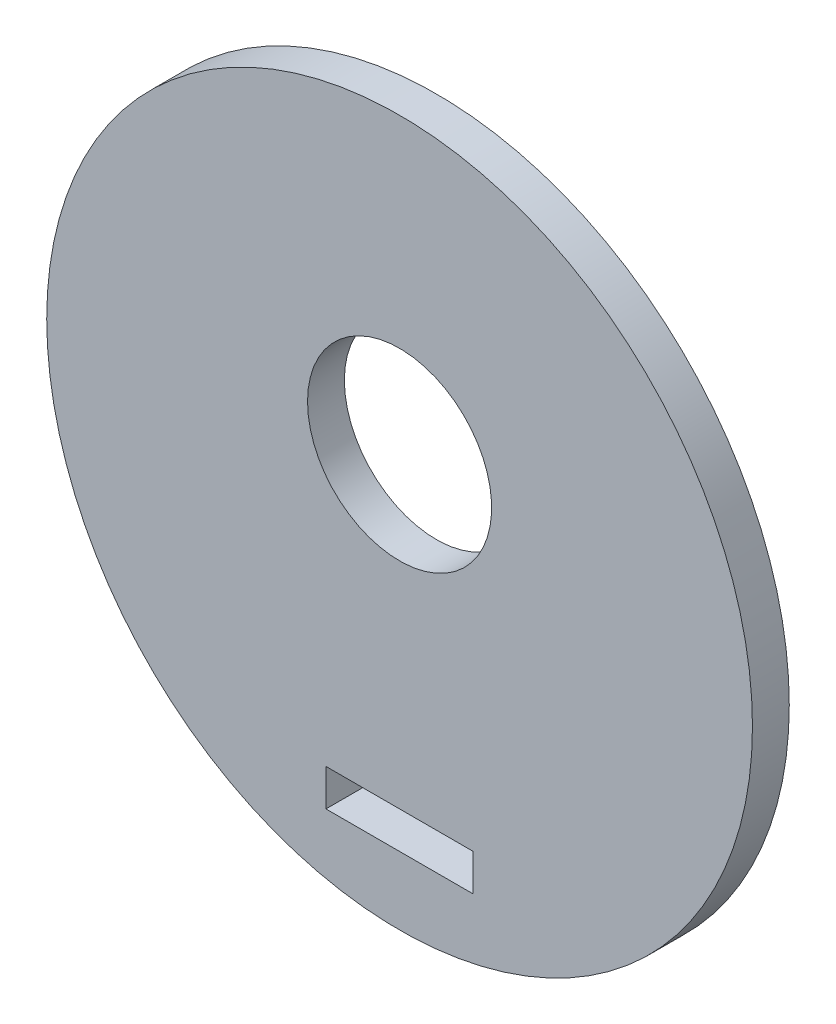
ISO-10303-21;
HEADER;
FILE_DESCRIPTION(('STEP AP214'),'2;1');
FILE_NAME('part.step','',(''),(''),'','','');
FILE_SCHEMA(('AUTOMOTIVE_DESIGN { 1 0 10303 214 1 1 1 1 }'));
ENDSEC;
DATA;
#1=APPLICATION_CONTEXT('core data for automotive mechanical design processes');
#2=APPLICATION_PROTOCOL_DEFINITION('international standard','automotive_design',2000,#1);
#3=PRODUCT_CONTEXT('',#1,'mechanical');
#4=PRODUCT('Part','Part','',(#3));
#5=PRODUCT_RELATED_PRODUCT_CATEGORY('part','',(#4));
#6=PRODUCT_DEFINITION_FORMATION('','',#4);
#7=PRODUCT_DEFINITION_CONTEXT('part definition',#1,'design');
#8=PRODUCT_DEFINITION('design','',#6,#7);
#9=PRODUCT_DEFINITION_SHAPE('','',#8);
#10=(LENGTH_UNIT() NAMED_UNIT(*) SI_UNIT(.MILLI.,.METRE.));
#11=(NAMED_UNIT(*) PLANE_ANGLE_UNIT() SI_UNIT($,.RADIAN.));
#12=(NAMED_UNIT(*) SI_UNIT($,.STERADIAN.) SOLID_ANGLE_UNIT());
#13=UNCERTAINTY_MEASURE_WITH_UNIT(LENGTH_MEASURE(1.E-05),#10,'distance_accuracy_value','');
#14=(GEOMETRIC_REPRESENTATION_CONTEXT(3) GLOBAL_UNCERTAINTY_ASSIGNED_CONTEXT((#13)) GLOBAL_UNIT_ASSIGNED_CONTEXT((#10,
#11,#12)) REPRESENTATION_CONTEXT('',''));
#15=CARTESIAN_POINT('',(0.,0.,0.));
#16=DIRECTION('',(0.,0.,1.));
#17=DIRECTION('',(1.,0.,0.));
#18=AXIS2_PLACEMENT_3D('',#15,#16,#17);
#19=CARTESIAN_POINT('',(0.,0.,3.81));
#20=DIRECTION('',(0.,0.,1.));
#21=DIRECTION('',(1.,0.,0.));
#22=AXIS2_PLACEMENT_3D('',#19,#20,#21);
#23=PLANE('',#22);
#24=CARTESIAN_POINT('',(0.,6.096,3.81));
#25=DIRECTION('',(0.,0.,1.));
#26=DIRECTION('',(1.,0.,0.));
#27=AXIS2_PLACEMENT_3D('',#24,#25,#26);
#28=CIRCLE('',#27,9.525);
#29=CARTESIAN_POINT('',(-9.525,6.096,3.81));
#30=VERTEX_POINT('',#29);
#31=EDGE_CURVE('E110',#30,#30,#28,.T.);
#32=ORIENTED_EDGE('',*,*,#31,.F.);
#33=EDGE_LOOP('',(#32));
#34=FACE_BOUND('',#33,.T.);
#35=CARTESIAN_POINT('',(0.,0.,3.81));
#36=DIRECTION('',(0.,0.,1.));
#37=DIRECTION('',(1.,0.,0.));
#38=AXIS2_PLACEMENT_3D('',#35,#36,#37);
#39=CIRCLE('',#38,36.5125);
#40=CARTESIAN_POINT('',(-36.5125,0.,3.81));
#41=VERTEX_POINT('',#40);
#42=EDGE_CURVE('E11',#41,#41,#39,.T.);
#43=ORIENTED_EDGE('',*,*,#42,.T.);
#44=EDGE_LOOP('',(#43));
#45=FACE_BOUND('',#44,.T.);
#46=DIRECTION('',(1.,0.,0.));
#47=VECTOR('',#46,1.);
#48=CARTESIAN_POINT('',(-7.61999999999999,-29.464,3.81));
#49=LINE('',#48,#47);
#50=CARTESIAN_POINT('',(-7.61999999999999,-29.464,3.81));
#51=VERTEX_POINT('',#50);
#52=CARTESIAN_POINT('',(7.62000000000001,-29.464,3.81));
#53=VERTEX_POINT('',#52);
#54=EDGE_CURVE('E98',#51,#53,#49,.T.);
#55=ORIENTED_EDGE('',*,*,#54,.F.);
#56=DIRECTION('',(0.,-1.,0.));
#57=VECTOR('',#56,1.);
#58=CARTESIAN_POINT('',(-7.61999999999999,-25.654,3.81));
#59=LINE('',#58,#57);
#60=CARTESIAN_POINT('',(-7.61999999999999,-25.654,3.81));
#61=VERTEX_POINT('',#60);
#62=EDGE_CURVE('E87',#61,#51,#59,.T.);
#63=ORIENTED_EDGE('',*,*,#62,.F.);
#64=DIRECTION('',(-1.,0.,0.));
#65=VECTOR('',#64,1.);
#66=CARTESIAN_POINT('',(-7.61999999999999,-25.654,3.81));
#67=LINE('',#66,#65);
#68=CARTESIAN_POINT('',(7.62000000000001,-25.654,3.81));
#69=VERTEX_POINT('',#68);
#70=EDGE_CURVE('E102',#69,#61,#67,.T.);
#71=ORIENTED_EDGE('',*,*,#70,.F.);
#72=DIRECTION('',(0.,1.,0.));
#73=VECTOR('',#72,1.);
#74=CARTESIAN_POINT('',(7.62000000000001,-29.464,3.81));
#75=LINE('',#74,#73);
#76=EDGE_CURVE('E100',#53,#69,#75,.T.);
#77=ORIENTED_EDGE('',*,*,#76,.F.);
#78=EDGE_LOOP('',(#55,#63,#71,#77));
#79=FACE_BOUND('',#78,.T.);
#80=ADVANCED_FACE('F31',(#34,#45,#79),#23,.T.);
#81=CARTESIAN_POINT('',(0.,0.,0.));
#82=DIRECTION('',(0.,0.,1.));
#83=DIRECTION('',(1.,0.,0.));
#84=AXIS2_PLACEMENT_3D('',#81,#82,#83);
#85=PLANE('',#84);
#86=CARTESIAN_POINT('',(0.,6.096,0.));
#87=DIRECTION('',(0.,0.,1.));
#88=DIRECTION('',(1.,0.,0.));
#89=AXIS2_PLACEMENT_3D('',#86,#87,#88);
#90=CIRCLE('',#89,9.525);
#91=CARTESIAN_POINT('',(-9.525,6.096,0.));
#92=VERTEX_POINT('',#91);
#93=EDGE_CURVE('E88',#92,#92,#90,.T.);
#94=ORIENTED_EDGE('',*,*,#93,.T.);
#95=EDGE_LOOP('',(#94));
#96=FACE_BOUND('',#95,.T.);
#97=CARTESIAN_POINT('',(0.,0.,0.));
#98=DIRECTION('',(0.,0.,1.));
#99=DIRECTION('',(1.,0.,0.));
#100=AXIS2_PLACEMENT_3D('',#97,#98,#99);
#101=CIRCLE('',#100,36.5125);
#102=CARTESIAN_POINT('',(-36.5125,0.,0.));
#103=VERTEX_POINT('',#102);
#104=EDGE_CURVE('E39',#103,#103,#101,.T.);
#105=ORIENTED_EDGE('',*,*,#104,.F.);
#106=EDGE_LOOP('',(#105));
#107=FACE_BOUND('',#106,.T.);
#108=DIRECTION('',(0.,-1.,0.));
#109=VECTOR('',#108,1.);
#110=CARTESIAN_POINT('',(-7.61999999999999,-25.654,0.));
#111=LINE('',#110,#109);
#112=CARTESIAN_POINT('',(-7.61999999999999,-25.654,0.));
#113=VERTEX_POINT('',#112);
#114=CARTESIAN_POINT('',(-7.61999999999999,-29.464,0.));
#115=VERTEX_POINT('',#114);
#116=EDGE_CURVE('E54',#113,#115,#111,.T.);
#117=ORIENTED_EDGE('',*,*,#116,.T.);
#118=DIRECTION('',(1.,0.,0.));
#119=VECTOR('',#118,1.);
#120=CARTESIAN_POINT('',(-7.61999999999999,-29.464,0.));
#121=LINE('',#120,#119);
#122=CARTESIAN_POINT('',(7.62000000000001,-29.464,0.));
#123=VERTEX_POINT('',#122);
#124=EDGE_CURVE('E74',#115,#123,#121,.T.);
#125=ORIENTED_EDGE('',*,*,#124,.T.);
#126=DIRECTION('',(0.,1.,0.));
#127=VECTOR('',#126,1.);
#128=CARTESIAN_POINT('',(7.62000000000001,-29.464,0.));
#129=LINE('',#128,#127);
#130=CARTESIAN_POINT('',(7.62000000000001,-25.654,0.));
#131=VERTEX_POINT('',#130);
#132=EDGE_CURVE('E83',#123,#131,#129,.T.);
#133=ORIENTED_EDGE('',*,*,#132,.T.);
#134=DIRECTION('',(-1.,0.,0.));
#135=VECTOR('',#134,1.);
#136=CARTESIAN_POINT('',(-7.61999999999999,-25.654,0.));
#137=LINE('',#136,#135);
#138=EDGE_CURVE('E92',#131,#113,#137,.T.);
#139=ORIENTED_EDGE('',*,*,#138,.T.);
#140=EDGE_LOOP('',(#117,#125,#133,#139));
#141=FACE_BOUND('',#140,.T.);
#142=ADVANCED_FACE('F91',(#96,#107,#141),#85,.F.);
#143=CARTESIAN_POINT('',(0.,0.,3.81));
#144=DIRECTION('',(0.,0.,-1.));
#145=DIRECTION('',(-1.,0.,0.));
#146=AXIS2_PLACEMENT_3D('',#143,#144,#145);
#147=CYLINDRICAL_SURFACE('',#146,36.5125);
#148=CARTESIAN_POINT('',(-36.5125,0.,3.81));
#149=CARTESIAN_POINT('',(-36.5125,0.,3.7703125));
#150=CARTESIAN_POINT('',(-36.5125,0.,3.730625));
#151=CARTESIAN_POINT('',(-36.5125,0.,3.65125));
#152=CARTESIAN_POINT('',(-36.5125,0.,3.6115625));
#153=CARTESIAN_POINT('',(-36.5125,0.,3.5321875));
#154=CARTESIAN_POINT('',(-36.5125,0.,3.4925));
#155=CARTESIAN_POINT('',(-36.5125,0.,3.413125));
#156=CARTESIAN_POINT('',(-36.5125,0.,3.3734375));
#157=CARTESIAN_POINT('',(-36.5125,0.,3.2940625));
#158=CARTESIAN_POINT('',(-36.5125,0.,3.254375));
#159=CARTESIAN_POINT('',(-36.5125,0.,3.175));
#160=CARTESIAN_POINT('',(-36.5125,0.,3.1353125));
#161=CARTESIAN_POINT('',(-36.5125,0.,3.0559375));
#162=CARTESIAN_POINT('',(-36.5125,0.,3.01625));
#163=CARTESIAN_POINT('',(-36.5125,0.,2.936875));
#164=CARTESIAN_POINT('',(-36.5125,0.,2.8971875));
#165=CARTESIAN_POINT('',(-36.5125,0.,2.8178125));
#166=CARTESIAN_POINT('',(-36.5125,0.,2.778125));
#167=CARTESIAN_POINT('',(-36.5125,0.,2.69875));
#168=CARTESIAN_POINT('',(-36.5125,0.,2.6590625));
#169=CARTESIAN_POINT('',(-36.5125,0.,2.5796875));
#170=CARTESIAN_POINT('',(-36.5125,0.,2.54));
#171=CARTESIAN_POINT('',(-36.5125,0.,2.460625));
#172=CARTESIAN_POINT('',(-36.5125,0.,2.4209375));
#173=CARTESIAN_POINT('',(-36.5125,0.,2.3415625));
#174=CARTESIAN_POINT('',(-36.5125,0.,2.301875));
#175=CARTESIAN_POINT('',(-36.5125,0.,2.2225));
#176=CARTESIAN_POINT('',(-36.5125,0.,2.1828125));
#177=CARTESIAN_POINT('',(-36.5125,0.,2.1034375));
#178=CARTESIAN_POINT('',(-36.5125,0.,2.06375));
#179=CARTESIAN_POINT('',(-36.5125,0.,1.984375));
#180=CARTESIAN_POINT('',(-36.5125,0.,1.9446875));
#181=CARTESIAN_POINT('',(-36.5125,0.,1.8653125));
#182=CARTESIAN_POINT('',(-36.5125,0.,1.825625));
#183=CARTESIAN_POINT('',(-36.5125,0.,1.74625));
#184=CARTESIAN_POINT('',(-36.5125,0.,1.7065625));
#185=CARTESIAN_POINT('',(-36.5125,0.,1.6271875));
#186=CARTESIAN_POINT('',(-36.5125,0.,1.5875));
#187=CARTESIAN_POINT('',(-36.5125,0.,1.508125));
#188=CARTESIAN_POINT('',(-36.5125,0.,1.4684375));
#189=CARTESIAN_POINT('',(-36.5125,0.,1.3890625));
#190=CARTESIAN_POINT('',(-36.5125,0.,1.349375));
#191=CARTESIAN_POINT('',(-36.5125,0.,1.27));
#192=CARTESIAN_POINT('',(-36.5125,0.,1.2303125));
#193=CARTESIAN_POINT('',(-36.5125,0.,1.1509375));
#194=CARTESIAN_POINT('',(-36.5125,0.,1.11125));
#195=CARTESIAN_POINT('',(-36.5125,0.,1.031875));
#196=CARTESIAN_POINT('',(-36.5125,0.,0.9921875));
#197=CARTESIAN_POINT('',(-36.5125,0.,0.9128125));
#198=CARTESIAN_POINT('',(-36.5125,0.,0.873125));
#199=CARTESIAN_POINT('',(-36.5125,0.,0.79375));
#200=CARTESIAN_POINT('',(-36.5125,0.,0.7540625));
#201=CARTESIAN_POINT('',(-36.5125,0.,0.6746875));
#202=CARTESIAN_POINT('',(-36.5125,0.,0.635));
#203=CARTESIAN_POINT('',(-36.5125,0.,0.555625));
#204=CARTESIAN_POINT('',(-36.5125,0.,0.5159375));
#205=CARTESIAN_POINT('',(-36.5125,0.,0.4365625));
#206=CARTESIAN_POINT('',(-36.5125,0.,0.396875));
#207=CARTESIAN_POINT('',(-36.5125,0.,0.3175));
#208=CARTESIAN_POINT('',(-36.5125,0.,0.2778125));
#209=CARTESIAN_POINT('',(-36.5125,0.,0.1984375));
#210=CARTESIAN_POINT('',(-36.5125,0.,0.15875));
#211=CARTESIAN_POINT('',(-36.5125,0.,0.0793749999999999));
#212=CARTESIAN_POINT('',(-36.5125,0.,0.0396874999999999));
#213=CARTESIAN_POINT('',(-36.5125,0.,0.));
#214=B_SPLINE_CURVE_WITH_KNOTS('',3,(#148,#149,#150,#151,#152,#153,#154,#155,#156,#157,#158,
#159,#160,#161,#162,#163,#164,#165,#166,#167,#168,#169,#170,#171,#172,#173,#174,#175,#176,#177,
#178,#179,#180,#181,#182,#183,#184,#185,#186,#187,#188,#189,#190,#191,#192,#193,#194,#195,#196,
#197,#198,#199,#200,#201,#202,#203,#204,#205,#206,#207,#208,#209,#210,#211,#212,#213),
.UNSPECIFIED.,.F.,.F.,(4,2,2,2,2,2,2,2,2,2,2,2,2,2,2,2,2,2,2,2,2,2,2,2,2,2,2,2,2,2,2,2,4),(0.,
0.1190625,0.238125,0.3571875,0.47625,0.5953125,0.714375,0.8334375,0.9525,1.0715625,1.190625,
1.3096875,1.42875,1.5478125,1.666875,1.7859375,1.905,2.0240625,2.143125,2.2621875,2.38125,
2.5003125,2.619375,2.7384375,2.8575,2.9765625,3.095625,3.2146875,3.33375,3.4528125,3.571875,
3.6909375,3.81),.UNSPECIFIED.);
#215=EDGE_CURVE('BSEAM33',#41,#103,#214,.T.);
#216=ORIENTED_EDGE('',*,*,#42,.F.);
#217=ORIENTED_EDGE('',*,*,#104,.T.);
#218=ORIENTED_EDGE('',*,*,#215,.T.);
#219=ORIENTED_EDGE('',*,*,#215,.F.);
#220=EDGE_LOOP('',(#216,#218,#217,#219));
#221=FACE_BOUND('',#220,.T.);
#222=ADVANCED_FACE('F33',(#221),#147,.T.);
#223=CARTESIAN_POINT('',(0.,6.096,3.81));
#224=DIRECTION('',(0.,0.,-1.));
#225=DIRECTION('',(-1.,0.,0.));
#226=AXIS2_PLACEMENT_3D('',#223,#224,#225);
#227=CYLINDRICAL_SURFACE('',#226,9.525);
#228=CARTESIAN_POINT('',(-9.525,6.096,3.81));
#229=CARTESIAN_POINT('',(-9.525,6.096,3.7703125));
#230=CARTESIAN_POINT('',(-9.525,6.096,3.730625));
#231=CARTESIAN_POINT('',(-9.525,6.096,3.65125));
#232=CARTESIAN_POINT('',(-9.525,6.096,3.6115625));
#233=CARTESIAN_POINT('',(-9.525,6.096,3.5321875));
#234=CARTESIAN_POINT('',(-9.525,6.096,3.4925));
#235=CARTESIAN_POINT('',(-9.525,6.096,3.413125));
#236=CARTESIAN_POINT('',(-9.525,6.096,3.3734375));
#237=CARTESIAN_POINT('',(-9.525,6.096,3.2940625));
#238=CARTESIAN_POINT('',(-9.525,6.096,3.254375));
#239=CARTESIAN_POINT('',(-9.525,6.096,3.175));
#240=CARTESIAN_POINT('',(-9.525,6.096,3.1353125));
#241=CARTESIAN_POINT('',(-9.525,6.096,3.0559375));
#242=CARTESIAN_POINT('',(-9.525,6.096,3.01625));
#243=CARTESIAN_POINT('',(-9.525,6.096,2.936875));
#244=CARTESIAN_POINT('',(-9.525,6.096,2.8971875));
#245=CARTESIAN_POINT('',(-9.525,6.096,2.8178125));
#246=CARTESIAN_POINT('',(-9.525,6.096,2.778125));
#247=CARTESIAN_POINT('',(-9.525,6.096,2.69875));
#248=CARTESIAN_POINT('',(-9.525,6.096,2.6590625));
#249=CARTESIAN_POINT('',(-9.525,6.096,2.5796875));
#250=CARTESIAN_POINT('',(-9.525,6.096,2.54));
#251=CARTESIAN_POINT('',(-9.525,6.096,2.460625));
#252=CARTESIAN_POINT('',(-9.525,6.096,2.4209375));
#253=CARTESIAN_POINT('',(-9.525,6.096,2.3415625));
#254=CARTESIAN_POINT('',(-9.525,6.096,2.301875));
#255=CARTESIAN_POINT('',(-9.525,6.096,2.2225));
#256=CARTESIAN_POINT('',(-9.525,6.096,2.1828125));
#257=CARTESIAN_POINT('',(-9.525,6.096,2.1034375));
#258=CARTESIAN_POINT('',(-9.525,6.096,2.06375));
#259=CARTESIAN_POINT('',(-9.525,6.096,1.984375));
#260=CARTESIAN_POINT('',(-9.525,6.096,1.9446875));
#261=CARTESIAN_POINT('',(-9.525,6.096,1.8653125));
#262=CARTESIAN_POINT('',(-9.525,6.096,1.825625));
#263=CARTESIAN_POINT('',(-9.525,6.096,1.74625));
#264=CARTESIAN_POINT('',(-9.525,6.096,1.7065625));
#265=CARTESIAN_POINT('',(-9.525,6.096,1.6271875));
#266=CARTESIAN_POINT('',(-9.525,6.096,1.5875));
#267=CARTESIAN_POINT('',(-9.525,6.096,1.508125));
#268=CARTESIAN_POINT('',(-9.525,6.096,1.4684375));
#269=CARTESIAN_POINT('',(-9.525,6.096,1.3890625));
#270=CARTESIAN_POINT('',(-9.525,6.096,1.349375));
#271=CARTESIAN_POINT('',(-9.525,6.096,1.27));
#272=CARTESIAN_POINT('',(-9.525,6.096,1.2303125));
#273=CARTESIAN_POINT('',(-9.525,6.096,1.1509375));
#274=CARTESIAN_POINT('',(-9.525,6.096,1.11125));
#275=CARTESIAN_POINT('',(-9.525,6.096,1.031875));
#276=CARTESIAN_POINT('',(-9.525,6.096,0.9921875));
#277=CARTESIAN_POINT('',(-9.525,6.096,0.9128125));
#278=CARTESIAN_POINT('',(-9.525,6.096,0.873125));
#279=CARTESIAN_POINT('',(-9.525,6.096,0.79375));
#280=CARTESIAN_POINT('',(-9.525,6.096,0.7540625));
#281=CARTESIAN_POINT('',(-9.525,6.096,0.6746875));
#282=CARTESIAN_POINT('',(-9.525,6.096,0.635));
#283=CARTESIAN_POINT('',(-9.525,6.096,0.555625));
#284=CARTESIAN_POINT('',(-9.525,6.096,0.5159375));
#285=CARTESIAN_POINT('',(-9.525,6.096,0.4365625));
#286=CARTESIAN_POINT('',(-9.525,6.096,0.396875));
#287=CARTESIAN_POINT('',(-9.525,6.096,0.3175));
#288=CARTESIAN_POINT('',(-9.525,6.096,0.2778125));
#289=CARTESIAN_POINT('',(-9.525,6.096,0.1984375));
#290=CARTESIAN_POINT('',(-9.525,6.096,0.15875));
#291=CARTESIAN_POINT('',(-9.525,6.096,0.0793749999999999));
#292=CARTESIAN_POINT('',(-9.525,6.096,0.0396874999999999));
#293=CARTESIAN_POINT('',(-9.525,6.096,0.));
#294=B_SPLINE_CURVE_WITH_KNOTS('',3,(#228,#229,#230,#231,#232,#233,#234,#235,#236,#237,#238,
#239,#240,#241,#242,#243,#244,#245,#246,#247,#248,#249,#250,#251,#252,#253,#254,#255,#256,#257,
#258,#259,#260,#261,#262,#263,#264,#265,#266,#267,#268,#269,#270,#271,#272,#273,#274,#275,#276,
#277,#278,#279,#280,#281,#282,#283,#284,#285,#286,#287,#288,#289,#290,#291,#292,#293),
.UNSPECIFIED.,.F.,.F.,(4,2,2,2,2,2,2,2,2,2,2,2,2,2,2,2,2,2,2,2,2,2,2,2,2,2,2,2,2,2,2,2,4),(0.,
0.1190625,0.238125,0.3571875,0.47625,0.5953125,0.714375,0.8334375,0.9525,1.0715625,1.190625,
1.3096875,1.42875,1.5478125,1.666875,1.7859375,1.905,2.0240625,2.143125,2.2621875,2.38125,
2.5003125,2.619375,2.7384375,2.8575,2.9765625,3.095625,3.2146875,3.33375,3.4528125,3.571875,
3.6909375,3.81),.UNSPECIFIED.);
#295=EDGE_CURVE('BSEAM123',#30,#92,#294,.T.);
#296=ORIENTED_EDGE('',*,*,#31,.T.);
#297=ORIENTED_EDGE('',*,*,#93,.F.);
#298=ORIENTED_EDGE('',*,*,#295,.T.);
#299=ORIENTED_EDGE('',*,*,#295,.F.);
#300=EDGE_LOOP('',(#296,#298,#297,#299));
#301=FACE_BOUND('',#300,.T.);
#302=ADVANCED_FACE('F123',(#301),#227,.F.);
#303=CARTESIAN_POINT('',(-7.61999999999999,-25.654,3.81));
#304=DIRECTION('',(1.,0.,0.));
#305=DIRECTION('',(0.,1.,0.));
#306=AXIS2_PLACEMENT_3D('',#303,#304,#305);
#307=PLANE('',#306);
#308=ORIENTED_EDGE('',*,*,#116,.F.);
#309=DIRECTION('',(0.,0.,-1.));
#310=VECTOR('',#309,1.);
#311=CARTESIAN_POINT('',(-7.61999999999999,-25.654,3.81));
#312=LINE('',#311,#310);
#313=EDGE_CURVE('E104',#61,#113,#312,.T.);
#314=ORIENTED_EDGE('',*,*,#313,.F.);
#315=ORIENTED_EDGE('',*,*,#62,.T.);
#316=DIRECTION('',(0.,0.,-1.));
#317=VECTOR('',#316,1.);
#318=CARTESIAN_POINT('',(-7.61999999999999,-29.464,3.81));
#319=LINE('',#318,#317);
#320=EDGE_CURVE('E76',#51,#115,#319,.T.);
#321=ORIENTED_EDGE('',*,*,#320,.T.);
#322=EDGE_LOOP('',(#308,#314,#315,#321));
#323=FACE_BOUND('',#322,.T.);
#324=ADVANCED_FACE('F85',(#323),#307,.T.);
#325=CARTESIAN_POINT('',(-7.61999999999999,-29.464,3.81));
#326=DIRECTION('',(0.,1.,0.));
#327=DIRECTION('',(0.,0.,1.));
#328=AXIS2_PLACEMENT_3D('',#325,#326,#327);
#329=PLANE('',#328);
#330=ORIENTED_EDGE('',*,*,#124,.F.);
#331=ORIENTED_EDGE('',*,*,#320,.F.);
#332=ORIENTED_EDGE('',*,*,#54,.T.);
#333=DIRECTION('',(0.,0.,-1.));
#334=VECTOR('',#333,1.);
#335=CARTESIAN_POINT('',(7.62000000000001,-29.464,3.81));
#336=LINE('',#335,#334);
#337=EDGE_CURVE('E79',#53,#123,#336,.T.);
#338=ORIENTED_EDGE('',*,*,#337,.T.);
#339=EDGE_LOOP('',(#330,#331,#332,#338));
#340=FACE_BOUND('',#339,.T.);
#341=ADVANCED_FACE('F75',(#340),#329,.T.);
#342=CARTESIAN_POINT('',(7.62000000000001,-29.464,3.81));
#343=DIRECTION('',(-1.,0.,0.));
#344=DIRECTION('',(0.,0.,1.));
#345=AXIS2_PLACEMENT_3D('',#342,#343,#344);
#346=PLANE('',#345);
#347=ORIENTED_EDGE('',*,*,#132,.F.);
#348=ORIENTED_EDGE('',*,*,#337,.F.);
#349=ORIENTED_EDGE('',*,*,#76,.T.);
#350=DIRECTION('',(0.,0.,-1.));
#351=VECTOR('',#350,1.);
#352=CARTESIAN_POINT('',(7.62000000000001,-25.654,3.81));
#353=LINE('',#352,#351);
#354=EDGE_CURVE('E46',#69,#131,#353,.T.);
#355=ORIENTED_EDGE('',*,*,#354,.T.);
#356=EDGE_LOOP('',(#347,#348,#349,#355));
#357=FACE_BOUND('',#356,.T.);
#358=ADVANCED_FACE('F134',(#357),#346,.T.);
#359=CARTESIAN_POINT('',(-7.61999999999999,-25.654,3.81));
#360=DIRECTION('',(0.,-1.,0.));
#361=DIRECTION('',(1.,0.,0.));
#362=AXIS2_PLACEMENT_3D('',#359,#360,#361);
#363=PLANE('',#362);
#364=ORIENTED_EDGE('',*,*,#138,.F.);
#365=ORIENTED_EDGE('',*,*,#354,.F.);
#366=ORIENTED_EDGE('',*,*,#70,.T.);
#367=ORIENTED_EDGE('',*,*,#313,.T.);
#368=EDGE_LOOP('',(#364,#365,#366,#367));
#369=FACE_BOUND('',#368,.T.);
#370=ADVANCED_FACE('F137',(#369),#363,.T.);
#371=CLOSED_SHELL('',(#80,#142,#222,#302,#324,#341,#358,#370));
#372=MANIFOLD_SOLID_BREP('B2',#371);
#373=ADVANCED_BREP_SHAPE_REPRESENTATION('',(#18,#372),#14);
#374=SHAPE_DEFINITION_REPRESENTATION(#9,#373);
ENDSEC;
END-ISO-10303-21;
